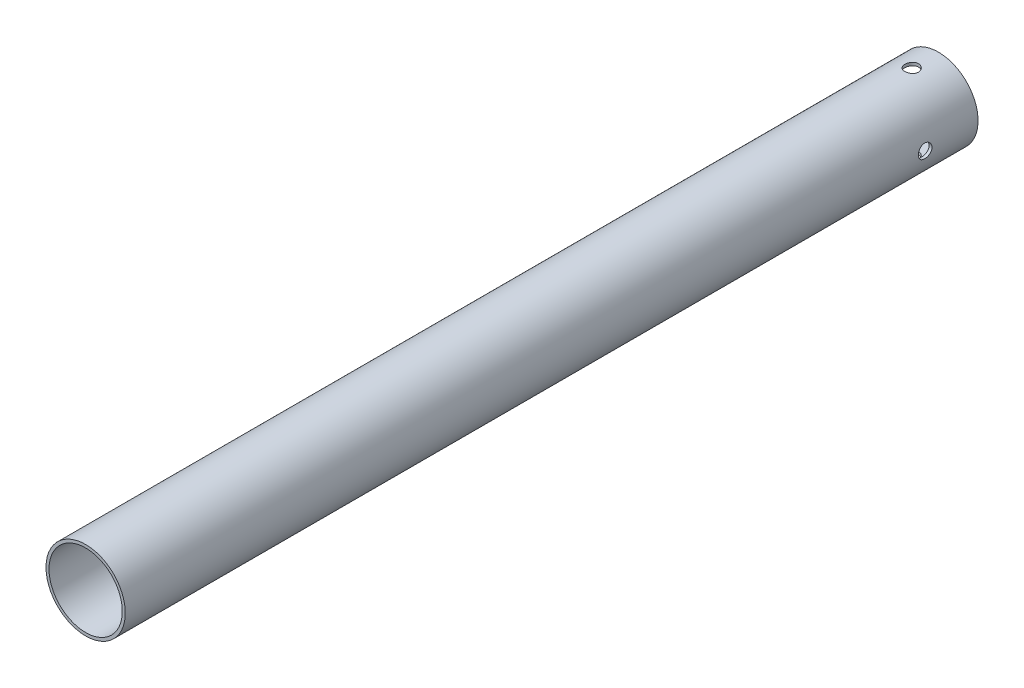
ISO-10303-21;
HEADER;
FILE_DESCRIPTION(('STEP AP214'),'2;1');
FILE_NAME('part.step','',(''),(''),'','','');
FILE_SCHEMA(('AUTOMOTIVE_DESIGN { 1 0 10303 214 1 1 1 1 }'));
ENDSEC;
DATA;
#1=APPLICATION_CONTEXT('core data for automotive mechanical design processes');
#2=APPLICATION_PROTOCOL_DEFINITION('international standard','automotive_design',2000,#1);
#3=PRODUCT_CONTEXT('',#1,'mechanical');
#4=PRODUCT('Part','Part','',(#3));
#5=PRODUCT_RELATED_PRODUCT_CATEGORY('part','',(#4));
#6=PRODUCT_DEFINITION_FORMATION('','',#4);
#7=PRODUCT_DEFINITION_CONTEXT('part definition',#1,'design');
#8=PRODUCT_DEFINITION('design','',#6,#7);
#9=PRODUCT_DEFINITION_SHAPE('','',#8);
#10=(LENGTH_UNIT() NAMED_UNIT(*) SI_UNIT(.MILLI.,.METRE.));
#11=(NAMED_UNIT(*) PLANE_ANGLE_UNIT() SI_UNIT($,.RADIAN.));
#12=(NAMED_UNIT(*) SI_UNIT($,.STERADIAN.) SOLID_ANGLE_UNIT());
#13=UNCERTAINTY_MEASURE_WITH_UNIT(LENGTH_MEASURE(1.E-05),#10,'distance_accuracy_value','');
#14=(GEOMETRIC_REPRESENTATION_CONTEXT(3) GLOBAL_UNCERTAINTY_ASSIGNED_CONTEXT((#13)) GLOBAL_UNIT_ASSIGNED_CONTEXT((#10,
#11,#12)) REPRESENTATION_CONTEXT('',''));
#15=CARTESIAN_POINT('',(0.,0.,0.));
#16=DIRECTION('',(0.,0.,1.));
#17=DIRECTION('',(1.,0.,0.));
#18=AXIS2_PLACEMENT_3D('',#15,#16,#17);
#19=CARTESIAN_POINT('',(0.,0.,153.67));
#20=DIRECTION('',(0.,0.,-1.));
#21=DIRECTION('',(-1.,0.,0.));
#22=AXIS2_PLACEMENT_3D('',#19,#20,#21);
#23=CYLINDRICAL_SURFACE('',#22,13.208);
#24=CARTESIAN_POINT('',(0.,0.,-153.67));
#25=DIRECTION('',(0.,0.,-1.));
#26=DIRECTION('',(-1.,0.,0.));
#27=AXIS2_PLACEMENT_3D('',#24,#25,#26);
#28=CIRCLE('',#27,13.208);
#29=CARTESIAN_POINT('',(-13.208,0.,-153.67));
#30=VERTEX_POINT('',#29);
#31=EDGE_CURVE('E95',#30,#30,#28,.T.);
#32=ORIENTED_EDGE('',*,*,#31,.T.);
#33=EDGE_LOOP('',(#32));
#34=FACE_BOUND('',#33,.T.);
#35=CARTESIAN_POINT('',(-13.208,0.,-132.16255));
#36=CARTESIAN_POINT('',(-13.2079970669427,0.136632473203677,-132.162556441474));
#37=CARTESIAN_POINT('',(-13.2058560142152,0.273436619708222,-132.173993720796));
#38=CARTESIAN_POINT('',(-13.1975150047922,0.543297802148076,-132.219441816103));
#39=CARTESIAN_POINT('',(-13.1913069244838,0.676346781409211,-132.253497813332));
#40=CARTESIAN_POINT('',(-13.175526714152,0.934597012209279,-132.34310879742));
#41=CARTESIAN_POINT('',(-13.1659590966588,1.05980852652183,-132.398634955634));
#42=CARTESIAN_POINT('',(-13.1445076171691,1.29908894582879,-132.529538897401));
#43=CARTESIAN_POINT('',(-13.1326245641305,1.41316172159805,-132.604909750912));
#44=CARTESIAN_POINT('',(-13.1076941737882,1.62833958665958,-132.774324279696));
#45=CARTESIAN_POINT('',(-13.0946357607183,1.729293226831,-132.868558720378));
#46=CARTESIAN_POINT('',(-13.0689083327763,1.91405914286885,-133.072619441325));
#47=CARTESIAN_POINT('',(-13.0562393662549,1.99786929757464,-133.182447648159));
#48=CARTESIAN_POINT('',(-13.0326197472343,2.14658323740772,-133.415629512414));
#49=CARTESIAN_POINT('',(-13.021683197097,2.21133520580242,-133.539081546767));
#50=CARTESIAN_POINT('',(-13.0029207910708,2.31912208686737,-133.795348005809));
#51=CARTESIAN_POINT('',(-12.9950946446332,2.3621590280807,-133.928161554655));
#52=CARTESIAN_POINT('',(-12.9835492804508,2.42481451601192,-134.197778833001));
#53=CARTESIAN_POINT('',(-12.9797842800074,2.44469432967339,-134.334519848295));
#54=CARTESIAN_POINT('',(-12.9766494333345,2.46128212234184,-134.609444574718));
#55=CARTESIAN_POINT('',(-12.977279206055,2.4579921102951,-134.747628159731));
#56=CARTESIAN_POINT('',(-12.9828210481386,2.4285456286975,-135.019623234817));
#57=CARTESIAN_POINT('',(-12.9876774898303,2.40268618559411,-135.153468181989));
#58=CARTESIAN_POINT('',(-13.001038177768,2.32930218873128,-135.414887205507));
#59=CARTESIAN_POINT('',(-13.0095426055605,2.28177655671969,-135.542460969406));
#60=CARTESIAN_POINT('',(-13.029299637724,2.16611626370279,-135.788589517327));
#61=CARTESIAN_POINT('',(-13.0405682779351,2.09786077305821,-135.907086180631));
#62=CARTESIAN_POINT('',(-13.0645723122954,1.94276922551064,-136.131047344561));
#63=CARTESIAN_POINT('',(-13.0773077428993,1.85593270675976,-136.236511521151));
#64=CARTESIAN_POINT('',(-13.103051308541,1.66455838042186,-136.433122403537));
#65=CARTESIAN_POINT('',(-13.1160606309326,1.55976958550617,-136.524024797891));
#66=CARTESIAN_POINT('',(-13.1407127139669,1.33624655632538,-136.68703708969));
#67=CARTESIAN_POINT('',(-13.1523548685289,1.21750618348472,-136.759138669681));
#68=CARTESIAN_POINT('',(-13.1729850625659,0.969165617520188,-136.882532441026));
#69=CARTESIAN_POINT('',(-13.1819677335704,0.839544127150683,-136.933782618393));
#70=CARTESIAN_POINT('',(-13.1962121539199,0.573495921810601,-137.01361157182));
#71=CARTESIAN_POINT('',(-13.201481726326,0.437084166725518,-137.04223802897));
#72=CARTESIAN_POINT('',(-13.2057336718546,0.249713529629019,-137.065243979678));
#73=CARTESIAN_POINT('',(-13.2065816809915,0.199891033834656,-137.069817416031));
#74=CARTESIAN_POINT('',(-13.207715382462,0.100053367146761,-137.075921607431));
#75=CARTESIAN_POINT('',(-13.2080010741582,0.0500381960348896,-137.077452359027));
#76=CARTESIAN_POINT('',(-13.2079970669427,-0.136632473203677,-137.077443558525));
#77=CARTESIAN_POINT('',(-13.2058560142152,-0.273436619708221,-137.066006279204));
#78=CARTESIAN_POINT('',(-13.1975150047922,-0.543297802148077,-137.020558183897));
#79=CARTESIAN_POINT('',(-13.1913069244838,-0.676346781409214,-136.986502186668));
#80=CARTESIAN_POINT('',(-13.175526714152,-0.93459701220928,-136.89689120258));
#81=CARTESIAN_POINT('',(-13.1659590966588,-1.05980852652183,-136.841365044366));
#82=CARTESIAN_POINT('',(-13.1445076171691,-1.29908894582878,-136.710461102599));
#83=CARTESIAN_POINT('',(-13.1326245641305,-1.41316172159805,-136.635090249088));
#84=CARTESIAN_POINT('',(-13.1076941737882,-1.62833958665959,-136.465675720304));
#85=CARTESIAN_POINT('',(-13.0946357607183,-1.72929322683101,-136.371441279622));
#86=CARTESIAN_POINT('',(-13.0689083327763,-1.91405914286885,-136.167380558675));
#87=CARTESIAN_POINT('',(-13.0562393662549,-1.99786929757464,-136.057552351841));
#88=CARTESIAN_POINT('',(-13.0326197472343,-2.14658323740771,-135.824370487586));
#89=CARTESIAN_POINT('',(-13.021683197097,-2.2113352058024,-135.700918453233));
#90=CARTESIAN_POINT('',(-13.0029207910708,-2.31912208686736,-135.444651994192));
#91=CARTESIAN_POINT('',(-12.9950946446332,-2.3621590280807,-135.311838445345));
#92=CARTESIAN_POINT('',(-12.9835492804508,-2.42481451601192,-135.042221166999));
#93=CARTESIAN_POINT('',(-12.9797842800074,-2.44469432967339,-134.905480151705));
#94=CARTESIAN_POINT('',(-12.9766494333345,-2.46128212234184,-134.630555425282));
#95=CARTESIAN_POINT('',(-12.977279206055,-2.4579921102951,-134.492371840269));
#96=CARTESIAN_POINT('',(-12.9828210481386,-2.4285456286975,-134.220376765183));
#97=CARTESIAN_POINT('',(-12.9876774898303,-2.40268618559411,-134.086531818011));
#98=CARTESIAN_POINT('',(-13.001038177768,-2.32930218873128,-133.825112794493));
#99=CARTESIAN_POINT('',(-13.0095426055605,-2.28177655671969,-133.697539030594));
#100=CARTESIAN_POINT('',(-13.029299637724,-2.1661162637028,-133.451410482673));
#101=CARTESIAN_POINT('',(-13.0405682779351,-2.09786077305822,-133.332913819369));
#102=CARTESIAN_POINT('',(-13.0645723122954,-1.94276922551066,-133.108952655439));
#103=CARTESIAN_POINT('',(-13.0773077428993,-1.85593270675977,-133.003488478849));
#104=CARTESIAN_POINT('',(-13.103051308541,-1.66455838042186,-132.806877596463));
#105=CARTESIAN_POINT('',(-13.1160606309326,-1.55976958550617,-132.715975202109));
#106=CARTESIAN_POINT('',(-13.1407127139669,-1.33624655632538,-132.55296291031));
#107=CARTESIAN_POINT('',(-13.1523548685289,-1.21750618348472,-132.480861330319));
#108=CARTESIAN_POINT('',(-13.1729850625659,-0.969165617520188,-132.357467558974));
#109=CARTESIAN_POINT('',(-13.1819677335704,-0.839544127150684,-132.306217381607));
#110=CARTESIAN_POINT('',(-13.1962121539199,-0.573495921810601,-132.22638842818));
#111=CARTESIAN_POINT('',(-13.201481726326,-0.437084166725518,-132.19776197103));
#112=CARTESIAN_POINT('',(-13.2057336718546,-0.249713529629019,-132.174756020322));
#113=CARTESIAN_POINT('',(-13.2065816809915,-0.199891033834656,-132.170182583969));
#114=CARTESIAN_POINT('',(-13.207715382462,-0.100053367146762,-132.164078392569));
#115=CARTESIAN_POINT('',(-13.2080010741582,-0.0500381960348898,-132.162547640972));
#116=CARTESIAN_POINT('',(-13.208,0.,-132.16255));
#117=B_SPLINE_CURVE_WITH_KNOTS('',3,(#35,#36,#37,#38,#39,#40,#41,#42,#43,#44,#45,#46,#47,#48,
#49,#50,#51,#52,#53,#54,#55,#56,#57,#58,#59,#60,#61,#62,#63,#64,#65,#66,#67,#68,#69,#70,#71,#72,
#73,#74,#75,#76,#77,#78,#79,#80,#81,#82,#83,#84,#85,#86,#87,#88,#89,#90,#91,#92,#93,#94,#95,#96,
#97,#98,#99,#100,#101,#102,#103,#104,#105,#106,#107,#108,#109,#110,#111,#112,#113,#114,#115,
#116),.UNSPECIFIED.,.T.,.F.,(4,2,2,2,2,2,2,2,2,2,2,2,2,2,2,2,2,2,2,2,2,2,2,2,2,2,2,2,2,2,2,2,2,
2,2,2,2,2,2,2,4),(0.,0.409706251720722,0.820233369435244,1.23021116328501,1.64004597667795,
2.05425630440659,2.46851785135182,2.88599522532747,3.30343359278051,3.71611520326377,
4.1287610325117,4.53605673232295,4.94337270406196,5.3531099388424,5.76285735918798,
6.17888713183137,6.59510064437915,7.01214869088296,7.42831541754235,7.57835982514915,
7.72840440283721,8.13811065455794,8.54863777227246,8.95861556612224,9.36845037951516,
9.7826607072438,10.196922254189,10.6143996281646,11.0318379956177,11.444519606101,
11.8571654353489,12.2644611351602,12.6717771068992,13.0815143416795,13.4912617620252,
13.9072915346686,14.3235050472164,14.7405530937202,15.1567198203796,15.3067642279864,
15.4568088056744),.UNSPECIFIED.);
#118=CARTESIAN_POINT('',(-13.208,0.,-132.16255));
#119=VERTEX_POINT('',#118);
#120=EDGE_CURVE('E58',#119,#119,#117,.T.);
#121=ORIENTED_EDGE('',*,*,#120,.T.);
#122=EDGE_LOOP('',(#121));
#123=FACE_BOUND('',#122,.T.);
#124=CARTESIAN_POINT('',(0.,0.,153.67));
#125=DIRECTION('',(0.,0.,-1.));
#126=DIRECTION('',(-1.,0.,0.));
#127=AXIS2_PLACEMENT_3D('',#124,#125,#126);
#128=CIRCLE('',#127,13.208);
#129=CARTESIAN_POINT('',(-13.208,0.,153.67));
#130=VERTEX_POINT('',#129);
#131=EDGE_CURVE('E82',#130,#130,#128,.T.);
#132=ORIENTED_EDGE('',*,*,#131,.F.);
#133=EDGE_LOOP('',(#132));
#134=FACE_BOUND('',#133,.T.);
#135=CARTESIAN_POINT('',(0.,13.208,-141.56055));
#136=CARTESIAN_POINT('',(0.136632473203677,13.2079970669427,-141.560556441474));
#137=CARTESIAN_POINT('',(0.273436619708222,13.2058560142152,-141.571993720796));
#138=CARTESIAN_POINT('',(0.543297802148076,13.1975150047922,-141.617441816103));
#139=CARTESIAN_POINT('',(0.676346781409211,13.1913069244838,-141.651497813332));
#140=CARTESIAN_POINT('',(0.934597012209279,13.175526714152,-141.74110879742));
#141=CARTESIAN_POINT('',(1.05980852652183,13.1659590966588,-141.796634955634));
#142=CARTESIAN_POINT('',(1.29908894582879,13.1445076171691,-141.927538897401));
#143=CARTESIAN_POINT('',(1.41316172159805,13.1326245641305,-142.002909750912));
#144=CARTESIAN_POINT('',(1.62833958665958,13.1076941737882,-142.172324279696));
#145=CARTESIAN_POINT('',(1.729293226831,13.0946357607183,-142.266558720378));
#146=CARTESIAN_POINT('',(1.91405914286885,13.0689083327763,-142.470619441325));
#147=CARTESIAN_POINT('',(1.99786929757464,13.0562393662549,-142.580447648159));
#148=CARTESIAN_POINT('',(2.14658323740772,13.0326197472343,-142.813629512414));
#149=CARTESIAN_POINT('',(2.21133520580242,13.021683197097,-142.937081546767));
#150=CARTESIAN_POINT('',(2.31912208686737,13.0029207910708,-143.193348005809));
#151=CARTESIAN_POINT('',(2.3621590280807,12.9950946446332,-143.326161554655));
#152=CARTESIAN_POINT('',(2.42481451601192,12.9835492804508,-143.595778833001));
#153=CARTESIAN_POINT('',(2.44469432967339,12.9797842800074,-143.732519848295));
#154=CARTESIAN_POINT('',(2.46128212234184,12.9766494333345,-144.007444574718));
#155=CARTESIAN_POINT('',(2.4579921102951,12.977279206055,-144.145628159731));
#156=CARTESIAN_POINT('',(2.4285456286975,12.9828210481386,-144.417623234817));
#157=CARTESIAN_POINT('',(2.40268618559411,12.9876774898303,-144.551468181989));
#158=CARTESIAN_POINT('',(2.32930218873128,13.001038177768,-144.812887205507));
#159=CARTESIAN_POINT('',(2.28177655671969,13.0095426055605,-144.940460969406));
#160=CARTESIAN_POINT('',(2.16611626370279,13.029299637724,-145.186589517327));
#161=CARTESIAN_POINT('',(2.09786077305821,13.0405682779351,-145.305086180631));
#162=CARTESIAN_POINT('',(1.94276922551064,13.0645723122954,-145.529047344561));
#163=CARTESIAN_POINT('',(1.85593270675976,13.0773077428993,-145.634511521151));
#164=CARTESIAN_POINT('',(1.66455838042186,13.103051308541,-145.831122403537));
#165=CARTESIAN_POINT('',(1.55976958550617,13.1160606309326,-145.922024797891));
#166=CARTESIAN_POINT('',(1.33624655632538,13.1407127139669,-146.08503708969));
#167=CARTESIAN_POINT('',(1.21750618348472,13.1523548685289,-146.157138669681));
#168=CARTESIAN_POINT('',(0.969165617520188,13.1729850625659,-146.280532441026));
#169=CARTESIAN_POINT('',(0.839544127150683,13.1819677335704,-146.331782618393));
#170=CARTESIAN_POINT('',(0.5734959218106,13.1962121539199,-146.41161157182));
#171=CARTESIAN_POINT('',(0.437084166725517,13.201481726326,-146.44023802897));
#172=CARTESIAN_POINT('',(0.249713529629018,13.2057336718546,-146.463243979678));
#173=CARTESIAN_POINT('',(0.199891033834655,13.2065816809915,-146.467817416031));
#174=CARTESIAN_POINT('',(0.100053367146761,13.207715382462,-146.473921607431));
#175=CARTESIAN_POINT('',(0.05003819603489,13.2080010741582,-146.475452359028));
#176=CARTESIAN_POINT('',(-0.136632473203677,13.2079970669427,-146.475443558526));
#177=CARTESIAN_POINT('',(-0.273436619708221,13.2058560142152,-146.464006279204));
#178=CARTESIAN_POINT('',(-0.543297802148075,13.1975150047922,-146.418558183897));
#179=CARTESIAN_POINT('',(-0.676346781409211,13.1913069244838,-146.384502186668));
#180=CARTESIAN_POINT('',(-0.934597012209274,13.175526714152,-146.29489120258));
#181=CARTESIAN_POINT('',(-1.05980852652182,13.1659590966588,-146.239365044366));
#182=CARTESIAN_POINT('',(-1.29908894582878,13.1445076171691,-146.108461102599));
#183=CARTESIAN_POINT('',(-1.41316172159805,13.1326245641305,-146.033090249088));
#184=CARTESIAN_POINT('',(-1.62833958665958,13.1076941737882,-145.863675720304));
#185=CARTESIAN_POINT('',(-1.729293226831,13.0946357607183,-145.769441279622));
#186=CARTESIAN_POINT('',(-1.91405914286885,13.0689083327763,-145.565380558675));
#187=CARTESIAN_POINT('',(-1.99786929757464,13.0562393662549,-145.455552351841));
#188=CARTESIAN_POINT('',(-2.14658323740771,13.0326197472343,-145.222370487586));
#189=CARTESIAN_POINT('',(-2.2113352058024,13.021683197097,-145.098918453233));
#190=CARTESIAN_POINT('',(-2.31912208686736,13.0029207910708,-144.842651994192));
#191=CARTESIAN_POINT('',(-2.3621590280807,12.9950946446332,-144.709838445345));
#192=CARTESIAN_POINT('',(-2.42481451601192,12.9835492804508,-144.440221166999));
#193=CARTESIAN_POINT('',(-2.44469432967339,12.9797842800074,-144.303480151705));
#194=CARTESIAN_POINT('',(-2.46128212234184,12.9766494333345,-144.028555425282));
#195=CARTESIAN_POINT('',(-2.45799211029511,12.977279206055,-143.890371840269));
#196=CARTESIAN_POINT('',(-2.4285456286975,12.9828210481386,-143.618376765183));
#197=CARTESIAN_POINT('',(-2.4026861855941,12.9876774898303,-143.484531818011));
#198=CARTESIAN_POINT('',(-2.32930218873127,13.001038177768,-143.223112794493));
#199=CARTESIAN_POINT('',(-2.28177655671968,13.0095426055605,-143.095539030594));
#200=CARTESIAN_POINT('',(-2.1661162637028,13.029299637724,-142.849410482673));
#201=CARTESIAN_POINT('',(-2.09786077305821,13.0405682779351,-142.730913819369));
#202=CARTESIAN_POINT('',(-1.94276922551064,13.0645723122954,-142.506952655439));
#203=CARTESIAN_POINT('',(-1.85593270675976,13.0773077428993,-142.401488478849));
#204=CARTESIAN_POINT('',(-1.66455838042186,13.103051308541,-142.204877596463));
#205=CARTESIAN_POINT('',(-1.55976958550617,13.1160606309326,-142.113975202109));
#206=CARTESIAN_POINT('',(-1.33624655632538,13.1407127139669,-141.95096291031));
#207=CARTESIAN_POINT('',(-1.21750618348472,13.1523548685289,-141.878861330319));
#208=CARTESIAN_POINT('',(-0.969165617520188,13.1729850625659,-141.755467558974));
#209=CARTESIAN_POINT('',(-0.839544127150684,13.1819677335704,-141.704217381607));
#210=CARTESIAN_POINT('',(-0.573495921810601,13.1962121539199,-141.62438842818));
#211=CARTESIAN_POINT('',(-0.437084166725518,13.201481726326,-141.59576197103));
#212=CARTESIAN_POINT('',(-0.249713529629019,13.2057336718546,-141.572756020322));
#213=CARTESIAN_POINT('',(-0.199891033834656,13.2065816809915,-141.568182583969));
#214=CARTESIAN_POINT('',(-0.100053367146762,13.207715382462,-141.562078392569));
#215=CARTESIAN_POINT('',(-0.0500381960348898,13.2080010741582,-141.560547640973));
#216=CARTESIAN_POINT('',(0.,13.208,-141.56055));
#217=B_SPLINE_CURVE_WITH_KNOTS('',3,(#135,#136,#137,#138,#139,#140,#141,#142,#143,#144,#145,
#146,#147,#148,#149,#150,#151,#152,#153,#154,#155,#156,#157,#158,#159,#160,#161,#162,#163,#164,
#165,#166,#167,#168,#169,#170,#171,#172,#173,#174,#175,#176,#177,#178,#179,#180,#181,#182,#183,
#184,#185,#186,#187,#188,#189,#190,#191,#192,#193,#194,#195,#196,#197,#198,#199,#200,#201,#202,
#203,#204,#205,#206,#207,#208,#209,#210,#211,#212,#213,#214,#215,#216),.UNSPECIFIED.,.T.,.F.,(4,
2,2,2,2,2,2,2,2,2,2,2,2,2,2,2,2,2,2,2,2,2,2,2,2,2,2,2,2,2,2,2,2,2,2,2,2,2,2,2,4),(0.,
0.409706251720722,0.820233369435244,1.23021116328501,1.64004597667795,2.05425630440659,
2.46851785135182,2.88599522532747,3.30343359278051,3.71611520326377,4.1287610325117,
4.53605673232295,4.94337270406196,5.3531099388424,5.76285735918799,6.17888713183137,
6.59510064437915,7.01214869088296,7.42831541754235,7.57835982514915,7.72840440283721,
8.13811065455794,8.54863777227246,8.95861556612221,9.36845037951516,9.7826607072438,
10.196922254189,10.6143996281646,11.0318379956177,11.444519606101,11.8571654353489,
12.2644611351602,12.6717771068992,13.0815143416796,13.4912617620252,13.9072915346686,
14.3235050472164,14.7405530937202,15.1567198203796,15.3067642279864,15.4568088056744),.UNSPECIFIED.);
#218=CARTESIAN_POINT('',(0.,13.208,-141.56055));
#219=VERTEX_POINT('',#218);
#220=EDGE_CURVE('E77',#219,#219,#217,.T.);
#221=ORIENTED_EDGE('',*,*,#220,.T.);
#222=EDGE_LOOP('',(#221));
#223=FACE_BOUND('',#222,.T.);
#224=CARTESIAN_POINT('',(13.208,0.,-137.07745));
#225=CARTESIAN_POINT('',(13.2079970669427,0.136632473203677,-137.077443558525));
#226=CARTESIAN_POINT('',(13.2058560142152,0.273436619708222,-137.066006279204));
#227=CARTESIAN_POINT('',(13.1975150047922,0.543297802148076,-137.020558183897));
#228=CARTESIAN_POINT('',(13.1913069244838,0.676346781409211,-136.986502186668));
#229=CARTESIAN_POINT('',(13.175526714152,0.934597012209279,-136.89689120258));
#230=CARTESIAN_POINT('',(13.1659590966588,1.05980852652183,-136.841365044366));
#231=CARTESIAN_POINT('',(13.1445076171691,1.29908894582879,-136.710461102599));
#232=CARTESIAN_POINT('',(13.1326245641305,1.41316172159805,-136.635090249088));
#233=CARTESIAN_POINT('',(13.1076941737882,1.62833958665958,-136.465675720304));
#234=CARTESIAN_POINT('',(13.0946357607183,1.729293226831,-136.371441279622));
#235=CARTESIAN_POINT('',(13.0689083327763,1.91405914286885,-136.167380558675));
#236=CARTESIAN_POINT('',(13.0562393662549,1.99786929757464,-136.057552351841));
#237=CARTESIAN_POINT('',(13.0326197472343,2.14658323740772,-135.824370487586));
#238=CARTESIAN_POINT('',(13.021683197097,2.21133520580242,-135.700918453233));
#239=CARTESIAN_POINT('',(13.0029207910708,2.31912208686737,-135.444651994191));
#240=CARTESIAN_POINT('',(12.9950946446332,2.3621590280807,-135.311838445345));
#241=CARTESIAN_POINT('',(12.9835492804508,2.42481451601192,-135.042221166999));
#242=CARTESIAN_POINT('',(12.9797842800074,2.44469432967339,-134.905480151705));
#243=CARTESIAN_POINT('',(12.9766494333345,2.46128212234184,-134.630555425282));
#244=CARTESIAN_POINT('',(12.977279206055,2.45799211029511,-134.492371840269));
#245=CARTESIAN_POINT('',(12.9828210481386,2.4285456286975,-134.220376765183));
#246=CARTESIAN_POINT('',(12.9876774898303,2.4026861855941,-134.086531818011));
#247=CARTESIAN_POINT('',(13.001038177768,2.32930218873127,-133.825112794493));
#248=CARTESIAN_POINT('',(13.0095426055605,2.28177655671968,-133.697539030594));
#249=CARTESIAN_POINT('',(13.029299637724,2.1661162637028,-133.451410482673));
#250=CARTESIAN_POINT('',(13.0405682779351,2.0978607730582,-133.332913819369));
#251=CARTESIAN_POINT('',(13.0645723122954,1.94276922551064,-133.108952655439));
#252=CARTESIAN_POINT('',(13.0773077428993,1.85593270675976,-133.003488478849));
#253=CARTESIAN_POINT('',(13.103051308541,1.66455838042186,-132.806877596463));
#254=CARTESIAN_POINT('',(13.1160606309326,1.55976958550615,-132.715975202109));
#255=CARTESIAN_POINT('',(13.1407127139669,1.33624655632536,-132.55296291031));
#256=CARTESIAN_POINT('',(13.1523548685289,1.21750618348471,-132.480861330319));
#257=CARTESIAN_POINT('',(13.1729850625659,0.96916561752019,-132.357467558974));
#258=CARTESIAN_POINT('',(13.1819677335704,0.839544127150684,-132.306217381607));
#259=CARTESIAN_POINT('',(13.1962121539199,0.5734959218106,-132.22638842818));
#260=CARTESIAN_POINT('',(13.201481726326,0.437084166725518,-132.19776197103));
#261=CARTESIAN_POINT('',(13.2057336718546,0.249713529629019,-132.174756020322));
#262=CARTESIAN_POINT('',(13.2065816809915,0.199891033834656,-132.170182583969));
#263=CARTESIAN_POINT('',(13.207715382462,0.100053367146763,-132.164078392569));
#264=CARTESIAN_POINT('',(13.2080010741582,0.0500381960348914,-132.162547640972));
#265=CARTESIAN_POINT('',(13.2079970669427,-0.136632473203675,-132.162556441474));
#266=CARTESIAN_POINT('',(13.2058560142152,-0.27343661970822,-132.173993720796));
#267=CARTESIAN_POINT('',(13.1975150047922,-0.543297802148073,-132.219441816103));
#268=CARTESIAN_POINT('',(13.1913069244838,-0.676346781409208,-132.253497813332));
#269=CARTESIAN_POINT('',(13.175526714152,-0.934597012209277,-132.34310879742));
#270=CARTESIAN_POINT('',(13.1659590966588,-1.05980852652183,-132.398634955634));
#271=CARTESIAN_POINT('',(13.1445076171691,-1.29908894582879,-132.529538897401));
#272=CARTESIAN_POINT('',(13.1326245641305,-1.41316172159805,-132.604909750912));
#273=CARTESIAN_POINT('',(13.1076941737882,-1.62833958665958,-132.774324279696));
#274=CARTESIAN_POINT('',(13.0946357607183,-1.729293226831,-132.868558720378));
#275=CARTESIAN_POINT('',(13.0689083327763,-1.91405914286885,-133.072619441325));
#276=CARTESIAN_POINT('',(13.0562393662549,-1.99786929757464,-133.182447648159));
#277=CARTESIAN_POINT('',(13.0326197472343,-2.14658323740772,-133.415629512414));
#278=CARTESIAN_POINT('',(13.021683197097,-2.21133520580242,-133.539081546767));
#279=CARTESIAN_POINT('',(13.0029207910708,-2.31912208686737,-133.795348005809));
#280=CARTESIAN_POINT('',(12.9950946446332,-2.3621590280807,-133.928161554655));
#281=CARTESIAN_POINT('',(12.9835492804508,-2.42481451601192,-134.197778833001));
#282=CARTESIAN_POINT('',(12.9797842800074,-2.4446943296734,-134.334519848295));
#283=CARTESIAN_POINT('',(12.9766494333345,-2.46128212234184,-134.609444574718));
#284=CARTESIAN_POINT('',(12.977279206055,-2.4579921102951,-134.747628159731));
#285=CARTESIAN_POINT('',(12.9828210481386,-2.4285456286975,-135.019623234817));
#286=CARTESIAN_POINT('',(12.9876774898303,-2.40268618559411,-135.153468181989));
#287=CARTESIAN_POINT('',(13.001038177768,-2.32930218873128,-135.414887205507));
#288=CARTESIAN_POINT('',(13.0095426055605,-2.28177655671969,-135.542460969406));
#289=CARTESIAN_POINT('',(13.029299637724,-2.16611626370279,-135.788589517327));
#290=CARTESIAN_POINT('',(13.0405682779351,-2.09786077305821,-135.907086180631));
#291=CARTESIAN_POINT('',(13.0645723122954,-1.94276922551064,-136.131047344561));
#292=CARTESIAN_POINT('',(13.0773077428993,-1.85593270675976,-136.236511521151));
#293=CARTESIAN_POINT('',(13.103051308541,-1.66455838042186,-136.433122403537));
#294=CARTESIAN_POINT('',(13.1160606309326,-1.55976958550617,-136.524024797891));
#295=CARTESIAN_POINT('',(13.1407127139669,-1.33624655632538,-136.68703708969));
#296=CARTESIAN_POINT('',(13.1523548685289,-1.21750618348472,-136.759138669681));
#297=CARTESIAN_POINT('',(13.1729850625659,-0.969165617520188,-136.882532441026));
#298=CARTESIAN_POINT('',(13.1819677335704,-0.839544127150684,-136.933782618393));
#299=CARTESIAN_POINT('',(13.1962121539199,-0.573495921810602,-137.01361157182));
#300=CARTESIAN_POINT('',(13.201481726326,-0.437084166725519,-137.04223802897));
#301=CARTESIAN_POINT('',(13.2057336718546,-0.24971352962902,-137.065243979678));
#302=CARTESIAN_POINT('',(13.2065816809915,-0.199891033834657,-137.069817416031));
#303=CARTESIAN_POINT('',(13.207715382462,-0.100053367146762,-137.075921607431));
#304=CARTESIAN_POINT('',(13.2080010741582,-0.0500381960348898,-137.077452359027));
#305=CARTESIAN_POINT('',(13.208,0.,-137.07745));
#306=B_SPLINE_CURVE_WITH_KNOTS('',3,(#224,#225,#226,#227,#228,#229,#230,#231,#232,#233,#234,
#235,#236,#237,#238,#239,#240,#241,#242,#243,#244,#245,#246,#247,#248,#249,#250,#251,#252,#253,
#254,#255,#256,#257,#258,#259,#260,#261,#262,#263,#264,#265,#266,#267,#268,#269,#270,#271,#272,
#273,#274,#275,#276,#277,#278,#279,#280,#281,#282,#283,#284,#285,#286,#287,#288,#289,#290,#291,
#292,#293,#294,#295,#296,#297,#298,#299,#300,#301,#302,#303,#304,#305),.UNSPECIFIED.,.T.,.F.,(4,
2,2,2,2,2,2,2,2,2,2,2,2,2,2,2,2,2,2,2,2,2,2,2,2,2,2,2,2,2,2,2,2,2,2,2,2,2,2,2,4),(0.,
0.409706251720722,0.820233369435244,1.23021116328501,1.64004597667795,2.05425630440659,
2.46851785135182,2.88599522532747,3.30343359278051,3.71611520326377,4.1287610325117,
4.53605673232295,4.94337270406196,5.3531099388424,5.76285735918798,6.17888713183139,
6.59510064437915,7.01214869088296,7.42831541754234,7.57835982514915,7.72840440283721,
8.13811065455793,8.54863777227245,8.95861556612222,9.36845037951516,9.7826607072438,
10.196922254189,10.6143996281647,11.0318379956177,11.444519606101,11.8571654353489,
12.2644611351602,12.6717771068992,13.0815143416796,13.4912617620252,13.9072915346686,
14.3235050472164,14.7405530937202,15.1567198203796,15.3067642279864,15.4568088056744),.UNSPECIFIED.);
#307=CARTESIAN_POINT('',(13.208,0.,-137.07745));
#308=VERTEX_POINT('',#307);
#309=EDGE_CURVE('E87',#308,#308,#306,.T.);
#310=ORIENTED_EDGE('',*,*,#309,.T.);
#311=EDGE_LOOP('',(#310));
#312=FACE_BOUND('',#311,.T.);
#313=CARTESIAN_POINT('',(0.,-13.208,-141.56055));
#314=CARTESIAN_POINT('',(-0.136632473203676,-13.2079970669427,-141.560556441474));
#315=CARTESIAN_POINT('',(-0.273436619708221,-13.2058560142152,-141.571993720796));
#316=CARTESIAN_POINT('',(-0.543297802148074,-13.1975150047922,-141.617441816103));
#317=CARTESIAN_POINT('',(-0.676346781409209,-13.1913069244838,-141.651497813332));
#318=CARTESIAN_POINT('',(-0.934597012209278,-13.175526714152,-141.74110879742));
#319=CARTESIAN_POINT('',(-1.05980852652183,-13.1659590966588,-141.796634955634));
#320=CARTESIAN_POINT('',(-1.29908894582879,-13.1445076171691,-141.927538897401));
#321=CARTESIAN_POINT('',(-1.41316172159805,-13.1326245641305,-142.002909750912));
#322=CARTESIAN_POINT('',(-1.62833958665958,-13.1076941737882,-142.172324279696));
#323=CARTESIAN_POINT('',(-1.729293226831,-13.0946357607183,-142.266558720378));
#324=CARTESIAN_POINT('',(-1.91405914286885,-13.0689083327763,-142.470619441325));
#325=CARTESIAN_POINT('',(-1.99786929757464,-13.0562393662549,-142.580447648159));
#326=CARTESIAN_POINT('',(-2.14658323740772,-13.0326197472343,-142.813629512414));
#327=CARTESIAN_POINT('',(-2.21133520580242,-13.021683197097,-142.937081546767));
#328=CARTESIAN_POINT('',(-2.31912208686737,-13.0029207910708,-143.193348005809));
#329=CARTESIAN_POINT('',(-2.3621590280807,-12.9950946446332,-143.326161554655));
#330=CARTESIAN_POINT('',(-2.42481451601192,-12.9835492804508,-143.595778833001));
#331=CARTESIAN_POINT('',(-2.44469432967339,-12.9797842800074,-143.732519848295));
#332=CARTESIAN_POINT('',(-2.46128212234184,-12.9766494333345,-144.007444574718));
#333=CARTESIAN_POINT('',(-2.4579921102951,-12.977279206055,-144.145628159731));
#334=CARTESIAN_POINT('',(-2.4285456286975,-12.9828210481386,-144.417623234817));
#335=CARTESIAN_POINT('',(-2.40268618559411,-12.9876774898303,-144.551468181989));
#336=CARTESIAN_POINT('',(-2.32930218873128,-13.001038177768,-144.812887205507));
#337=CARTESIAN_POINT('',(-2.28177655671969,-13.0095426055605,-144.940460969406));
#338=CARTESIAN_POINT('',(-2.16611626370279,-13.029299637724,-145.186589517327));
#339=CARTESIAN_POINT('',(-2.09786077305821,-13.0405682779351,-145.305086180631));
#340=CARTESIAN_POINT('',(-1.94276922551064,-13.0645723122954,-145.529047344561));
#341=CARTESIAN_POINT('',(-1.85593270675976,-13.0773077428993,-145.634511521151));
#342=CARTESIAN_POINT('',(-1.66455838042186,-13.103051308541,-145.831122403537));
#343=CARTESIAN_POINT('',(-1.55976958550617,-13.1160606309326,-145.922024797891));
#344=CARTESIAN_POINT('',(-1.33624655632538,-13.1407127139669,-146.08503708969));
#345=CARTESIAN_POINT('',(-1.21750618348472,-13.1523548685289,-146.157138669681));
#346=CARTESIAN_POINT('',(-0.969165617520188,-13.1729850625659,-146.280532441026));
#347=CARTESIAN_POINT('',(-0.839544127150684,-13.1819677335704,-146.331782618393));
#348=CARTESIAN_POINT('',(-0.573495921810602,-13.1962121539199,-146.41161157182));
#349=CARTESIAN_POINT('',(-0.437084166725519,-13.201481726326,-146.44023802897));
#350=CARTESIAN_POINT('',(-0.249713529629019,-13.2057336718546,-146.463243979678));
#351=CARTESIAN_POINT('',(-0.199891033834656,-13.2065816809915,-146.467817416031));
#352=CARTESIAN_POINT('',(-0.100053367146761,-13.207715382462,-146.473921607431));
#353=CARTESIAN_POINT('',(-0.0500381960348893,-13.2080010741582,-146.475452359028));
#354=CARTESIAN_POINT('',(0.136632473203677,-13.2079970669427,-146.475443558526));
#355=CARTESIAN_POINT('',(0.273436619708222,-13.2058560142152,-146.464006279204));
#356=CARTESIAN_POINT('',(0.543297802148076,-13.1975150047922,-146.418558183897));
#357=CARTESIAN_POINT('',(0.676346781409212,-13.1913069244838,-146.384502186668));
#358=CARTESIAN_POINT('',(0.934597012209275,-13.175526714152,-146.29489120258));
#359=CARTESIAN_POINT('',(1.05980852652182,-13.1659590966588,-146.239365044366));
#360=CARTESIAN_POINT('',(1.29908894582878,-13.1445076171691,-146.108461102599));
#361=CARTESIAN_POINT('',(1.41316172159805,-13.1326245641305,-146.033090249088));
#362=CARTESIAN_POINT('',(1.62833958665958,-13.1076941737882,-145.863675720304));
#363=CARTESIAN_POINT('',(1.729293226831,-13.0946357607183,-145.769441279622));
#364=CARTESIAN_POINT('',(1.91405914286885,-13.0689083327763,-145.565380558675));
#365=CARTESIAN_POINT('',(1.99786929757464,-13.0562393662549,-145.455552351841));
#366=CARTESIAN_POINT('',(2.14658323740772,-13.0326197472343,-145.222370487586));
#367=CARTESIAN_POINT('',(2.21133520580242,-13.021683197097,-145.098918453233));
#368=CARTESIAN_POINT('',(2.31912208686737,-13.0029207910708,-144.842651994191));
#369=CARTESIAN_POINT('',(2.3621590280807,-12.9950946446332,-144.709838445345));
#370=CARTESIAN_POINT('',(2.42481451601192,-12.9835492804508,-144.440221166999));
#371=CARTESIAN_POINT('',(2.44469432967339,-12.9797842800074,-144.303480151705));
#372=CARTESIAN_POINT('',(2.46128212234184,-12.9766494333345,-144.028555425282));
#373=CARTESIAN_POINT('',(2.45799211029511,-12.977279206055,-143.890371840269));
#374=CARTESIAN_POINT('',(2.4285456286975,-12.9828210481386,-143.618376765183));
#375=CARTESIAN_POINT('',(2.4026861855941,-12.9876774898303,-143.484531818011));
#376=CARTESIAN_POINT('',(2.32930218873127,-13.001038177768,-143.223112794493));
#377=CARTESIAN_POINT('',(2.28177655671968,-13.0095426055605,-143.095539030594));
#378=CARTESIAN_POINT('',(2.1661162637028,-13.029299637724,-142.849410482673));
#379=CARTESIAN_POINT('',(2.09786077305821,-13.0405682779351,-142.730913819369));
#380=CARTESIAN_POINT('',(1.94276922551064,-13.0645723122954,-142.506952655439));
#381=CARTESIAN_POINT('',(1.85593270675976,-13.0773077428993,-142.401488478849));
#382=CARTESIAN_POINT('',(1.66455838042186,-13.103051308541,-142.204877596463));
#383=CARTESIAN_POINT('',(1.55976958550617,-13.1160606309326,-142.113975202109));
#384=CARTESIAN_POINT('',(1.33624655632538,-13.1407127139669,-141.95096291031));
#385=CARTESIAN_POINT('',(1.21750618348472,-13.1523548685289,-141.878861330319));
#386=CARTESIAN_POINT('',(0.969165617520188,-13.1729850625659,-141.755467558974));
#387=CARTESIAN_POINT('',(0.839544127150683,-13.1819677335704,-141.704217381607));
#388=CARTESIAN_POINT('',(0.5734959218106,-13.1962121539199,-141.62438842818));
#389=CARTESIAN_POINT('',(0.437084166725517,-13.201481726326,-141.59576197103));
#390=CARTESIAN_POINT('',(0.249713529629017,-13.2057336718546,-141.572756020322));
#391=CARTESIAN_POINT('',(0.199891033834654,-13.2065816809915,-141.568182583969));
#392=CARTESIAN_POINT('',(0.100053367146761,-13.207715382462,-141.562078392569));
#393=CARTESIAN_POINT('',(0.0500381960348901,-13.2080010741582,-141.560547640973));
#394=CARTESIAN_POINT('',(0.,-13.208,-141.56055));
#395=B_SPLINE_CURVE_WITH_KNOTS('',3,(#313,#314,#315,#316,#317,#318,#319,#320,#321,#322,#323,
#324,#325,#326,#327,#328,#329,#330,#331,#332,#333,#334,#335,#336,#337,#338,#339,#340,#341,#342,
#343,#344,#345,#346,#347,#348,#349,#350,#351,#352,#353,#354,#355,#356,#357,#358,#359,#360,#361,
#362,#363,#364,#365,#366,#367,#368,#369,#370,#371,#372,#373,#374,#375,#376,#377,#378,#379,#380,
#381,#382,#383,#384,#385,#386,#387,#388,#389,#390,#391,#392,#393,#394),.UNSPECIFIED.,.T.,.F.,(4,
2,2,2,2,2,2,2,2,2,2,2,2,2,2,2,2,2,2,2,2,2,2,2,2,2,2,2,2,2,2,2,2,2,2,2,2,2,2,2,4),(0.,
0.409706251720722,0.820233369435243,1.23021116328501,1.64004597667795,2.05425630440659,
2.46851785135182,2.88599522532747,3.30343359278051,3.71611520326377,4.1287610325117,
4.53605673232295,4.94337270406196,5.3531099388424,5.76285735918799,6.17888713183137,
6.59510064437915,7.01214869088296,7.42831541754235,7.57835982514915,7.72840440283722,
8.13811065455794,8.54863777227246,8.95861556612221,9.36845037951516,9.7826607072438,
10.196922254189,10.6143996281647,11.0318379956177,11.444519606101,11.8571654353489,
12.2644611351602,12.6717771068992,13.0815143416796,13.4912617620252,13.9072915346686,
14.3235050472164,14.7405530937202,15.1567198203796,15.3067642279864,15.4568088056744),.UNSPECIFIED.);
#396=CARTESIAN_POINT('',(0.,-13.208,-141.56055));
#397=VERTEX_POINT('',#396);
#398=EDGE_CURVE('E16',#397,#397,#395,.T.);
#399=ORIENTED_EDGE('',*,*,#398,.T.);
#400=EDGE_LOOP('',(#399));
#401=FACE_BOUND('',#400,.T.);
#402=ADVANCED_FACE('F12',(#34,#123,#134,#223,#312,#401),#23,.F.);
#403=CARTESIAN_POINT('',(0.,14.2875,-144.018));
#404=DIRECTION('',(0.,1.,0.));
#405=DIRECTION('',(0.,0.,1.));
#406=AXIS2_PLACEMENT_3D('',#403,#404,#405);
#407=CYLINDRICAL_SURFACE('',#406,2.45745);
#408=ORIENTED_EDGE('',*,*,#398,.F.);
#409=EDGE_LOOP('',(#408));
#410=FACE_BOUND('',#409,.T.);
#411=CARTESIAN_POINT('',(0.,-14.2875,-146.47545));
#412=CARTESIAN_POINT('',(-0.136817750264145,-14.2874973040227,-146.475443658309));
#413=CARTESIAN_POINT('',(-0.273809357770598,-14.2855125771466,-146.463975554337));
#414=CARTESIAN_POINT('',(-0.544049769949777,-14.2777808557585,-146.418399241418));
#415=CARTESIAN_POINT('',(-0.677290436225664,-14.2720262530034,-146.384245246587));
#416=CARTESIAN_POINT('',(-0.935925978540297,-14.2573999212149,-146.294359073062));
#417=CARTESIAN_POINT('',(-1.06133058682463,-14.2485321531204,-146.238654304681));
#418=CARTESIAN_POINT('',(-1.30096184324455,-14.2286551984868,-146.107312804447));
#419=CARTESIAN_POINT('',(-1.41519256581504,-14.217646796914,-146.031683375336));
#420=CARTESIAN_POINT('',(-1.63046228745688,-14.1945796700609,-145.861806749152));
#421=CARTESIAN_POINT('',(-1.73137032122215,-14.18251221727,-145.767394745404));
#422=CARTESIAN_POINT('',(-1.91600065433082,-14.1587529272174,-145.562983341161));
#423=CARTESIAN_POINT('',(-1.99972094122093,-14.1470611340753,-145.452982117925));
#424=CARTESIAN_POINT('',(-2.14811519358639,-14.1252942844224,-145.219625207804));
#425=CARTESIAN_POINT('',(-2.21266060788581,-14.1152303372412,-145.096186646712));
#426=CARTESIAN_POINT('',(-2.32004981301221,-14.0979786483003,-144.840018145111));
#427=CARTESIAN_POINT('',(-2.36289535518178,-14.0907906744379,-144.707288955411));
#428=CARTESIAN_POINT('',(-2.42525964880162,-14.0801907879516,-144.437681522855));
#429=CARTESIAN_POINT('',(-2.44500247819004,-14.0767426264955,-144.300856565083));
#430=CARTESIAN_POINT('',(-2.4612958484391,-14.0739032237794,-144.025795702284));
#431=CARTESIAN_POINT('',(-2.4578480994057,-14.0745116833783,-143.887559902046));
#432=CARTESIAN_POINT('',(-2.42804056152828,-14.0796836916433,-143.615208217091));
#433=CARTESIAN_POINT('',(-2.40193344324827,-14.0842036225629,-143.48106372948));
#434=CARTESIAN_POINT('',(-2.32794474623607,-14.0966210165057,-143.219086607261));
#435=CARTESIAN_POINT('',(-2.28006219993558,-14.1045186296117,-143.091254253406));
#436=CARTESIAN_POINT('',(-2.16362613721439,-14.1228485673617,-142.844775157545));
#437=CARTESIAN_POINT('',(-2.09496775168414,-14.1332936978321,-142.726178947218));
#438=CARTESIAN_POINT('',(-1.9390089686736,-14.155531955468,-142.502104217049));
#439=CARTESIAN_POINT('',(-1.85170839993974,-14.1673250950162,-142.396625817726));
#440=CARTESIAN_POINT('',(-1.659587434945,-14.1911203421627,-142.200326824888));
#441=CARTESIAN_POINT('',(-1.55455356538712,-14.203123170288,-142.109715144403));
#442=CARTESIAN_POINT('',(-1.33060746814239,-14.2258492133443,-141.94732923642));
#443=CARTESIAN_POINT('',(-1.2116890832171,-14.2365718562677,-141.875563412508));
#444=CARTESIAN_POINT('',(-0.963116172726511,-14.2555471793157,-141.752890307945));
#445=CARTESIAN_POINT('',(-0.833443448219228,-14.2637955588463,-141.702019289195));
#446=CARTESIAN_POINT('',(-0.5673909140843,-14.2768471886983,-141.622939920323));
#447=CARTESIAN_POINT('',(-0.431025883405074,-14.2816576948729,-141.594683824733));
#448=CARTESIAN_POINT('',(-0.244721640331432,-14.2854879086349,-141.572271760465));
#449=CARTESIAN_POINT('',(-0.195890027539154,-14.2862408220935,-141.567879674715));
#450=CARTESIAN_POINT('',(-0.0980463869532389,-14.2872473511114,-141.562017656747));
#451=CARTESIAN_POINT('',(-0.0490343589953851,-14.2875009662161,-141.56054772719));
#452=CARTESIAN_POINT('',(0.136817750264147,-14.2874973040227,-141.560556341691));
#453=CARTESIAN_POINT('',(0.273809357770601,-14.2855125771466,-141.572024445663));
#454=CARTESIAN_POINT('',(0.54404976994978,-14.2777808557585,-141.617600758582));
#455=CARTESIAN_POINT('',(0.677290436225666,-14.2720262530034,-141.651754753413));
#456=CARTESIAN_POINT('',(0.935925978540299,-14.2573999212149,-141.741640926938));
#457=CARTESIAN_POINT('',(1.06133058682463,-14.2485321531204,-141.797345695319));
#458=CARTESIAN_POINT('',(1.30096184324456,-14.2286551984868,-141.928687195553));
#459=CARTESIAN_POINT('',(1.41519256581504,-14.217646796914,-142.004316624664));
#460=CARTESIAN_POINT('',(1.63046228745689,-14.1945796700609,-142.174193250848));
#461=CARTESIAN_POINT('',(1.73137032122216,-14.18251221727,-142.268605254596));
#462=CARTESIAN_POINT('',(1.91600065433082,-14.1587529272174,-142.473016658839));
#463=CARTESIAN_POINT('',(1.99972094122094,-14.1470611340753,-142.583017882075));
#464=CARTESIAN_POINT('',(2.14811519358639,-14.1252942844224,-142.816374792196));
#465=CARTESIAN_POINT('',(2.21266060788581,-14.1152303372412,-142.939813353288));
#466=CARTESIAN_POINT('',(2.32004981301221,-14.0979786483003,-143.195981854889));
#467=CARTESIAN_POINT('',(2.36289535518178,-14.0907906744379,-143.328711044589));
#468=CARTESIAN_POINT('',(2.42525964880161,-14.0801907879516,-143.598318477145));
#469=CARTESIAN_POINT('',(2.44500247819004,-14.0767426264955,-143.735143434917));
#470=CARTESIAN_POINT('',(2.4612958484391,-14.0739032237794,-144.010204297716));
#471=CARTESIAN_POINT('',(2.4578480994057,-14.0745116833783,-144.148440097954));
#472=CARTESIAN_POINT('',(2.42804056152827,-14.0796836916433,-144.420791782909));
#473=CARTESIAN_POINT('',(2.40193344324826,-14.0842036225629,-144.55493627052));
#474=CARTESIAN_POINT('',(2.32794474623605,-14.0966210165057,-144.816913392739));
#475=CARTESIAN_POINT('',(2.28006219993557,-14.1045186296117,-144.944745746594));
#476=CARTESIAN_POINT('',(2.16362613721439,-14.1228485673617,-145.191224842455));
#477=CARTESIAN_POINT('',(2.09496775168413,-14.1332936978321,-145.309821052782));
#478=CARTESIAN_POINT('',(1.93900896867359,-14.155531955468,-145.533895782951));
#479=CARTESIAN_POINT('',(1.85170839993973,-14.1673250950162,-145.639374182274));
#480=CARTESIAN_POINT('',(1.659587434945,-14.1911203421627,-145.835673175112));
#481=CARTESIAN_POINT('',(1.55455356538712,-14.203123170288,-145.926284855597));
#482=CARTESIAN_POINT('',(1.33060746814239,-14.2258492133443,-146.08867076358));
#483=CARTESIAN_POINT('',(1.2116890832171,-14.2365718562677,-146.160436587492));
#484=CARTESIAN_POINT('',(0.963116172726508,-14.2555471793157,-146.283109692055));
#485=CARTESIAN_POINT('',(0.833443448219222,-14.2637955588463,-146.333980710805));
#486=CARTESIAN_POINT('',(0.567390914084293,-14.2768471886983,-146.413060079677));
#487=CARTESIAN_POINT('',(0.431025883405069,-14.2816576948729,-146.441316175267));
#488=CARTESIAN_POINT('',(0.244721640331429,-14.2854879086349,-146.463728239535));
#489=CARTESIAN_POINT('',(0.19589002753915,-14.2862408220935,-146.468120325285));
#490=CARTESIAN_POINT('',(0.0980463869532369,-14.2872473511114,-146.473982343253));
#491=CARTESIAN_POINT('',(0.0490343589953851,-14.2875009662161,-146.47545227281));
#492=CARTESIAN_POINT('',(0.,-14.2875,-146.47545));
#493=B_SPLINE_CURVE_WITH_KNOTS('',3,(#411,#412,#413,#414,#415,#416,#417,#418,#419,#420,#421,
#422,#423,#424,#425,#426,#427,#428,#429,#430,#431,#432,#433,#434,#435,#436,#437,#438,#439,#440,
#441,#442,#443,#444,#445,#446,#447,#448,#449,#450,#451,#452,#453,#454,#455,#456,#457,#458,#459,
#460,#461,#462,#463,#464,#465,#466,#467,#468,#469,#470,#471,#472,#473,#474,#475,#476,#477,#478,
#479,#480,#481,#482,#483,#484,#485,#486,#487,#488,#489,#490,#491,#492),.UNSPECIFIED.,.T.,.F.,(4,
2,2,2,2,2,2,2,2,2,2,2,2,2,2,2,2,2,2,2,2,2,2,2,2,2,2,2,2,2,2,2,2,2,2,2,2,2,2,2,4),(0.,
0.410266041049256,0.821362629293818,1.23193805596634,1.64236320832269,2.05656247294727,
2.47081020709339,2.88777549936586,3.30470713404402,3.71756043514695,4.13038329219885,
4.53866112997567,4.94695711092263,5.35734941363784,5.76774548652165,6.18348934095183,
6.59941826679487,7.01606599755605,7.43183174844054,7.57886759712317,7.72590357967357,
8.13616962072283,8.54726620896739,8.95784163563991,9.36826678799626,9.78246605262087,
10.196713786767,10.6136790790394,11.0306107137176,11.4434640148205,11.8562868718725,
12.2645647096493,12.6728606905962,13.0832529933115,13.4936490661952,13.9093929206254,
14.3253218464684,14.7419695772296,15.1577353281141,15.3047711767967,15.4518071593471),.UNSPECIFIED.);
#494=CARTESIAN_POINT('',(0.,-14.2875,-146.47545));
#495=VERTEX_POINT('',#494);
#496=EDGE_CURVE('E53',#495,#495,#493,.T.);
#497=ORIENTED_EDGE('',*,*,#496,.F.);
#498=EDGE_LOOP('',(#497));
#499=FACE_BOUND('',#498,.T.);
#500=ADVANCED_FACE('F65',(#410,#499),#407,.F.);
#501=CARTESIAN_POINT('',(0.,14.2875,-144.018));
#502=DIRECTION('',(0.,1.,0.));
#503=DIRECTION('',(0.,0.,1.));
#504=AXIS2_PLACEMENT_3D('',#501,#502,#503);
#505=CYLINDRICAL_SURFACE('',#504,2.45745);
#506=ORIENTED_EDGE('',*,*,#220,.F.);
#507=EDGE_LOOP('',(#506));
#508=FACE_BOUND('',#507,.T.);
#509=CARTESIAN_POINT('',(0.,14.2875,-141.56055));
#510=CARTESIAN_POINT('',(-0.136817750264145,14.2874973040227,-141.560556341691));
#511=CARTESIAN_POINT('',(-0.273809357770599,14.2855125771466,-141.572024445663));
#512=CARTESIAN_POINT('',(-0.544049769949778,14.2777808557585,-141.617600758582));
#513=CARTESIAN_POINT('',(-0.677290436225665,14.2720262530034,-141.651754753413));
#514=CARTESIAN_POINT('',(-0.935925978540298,14.2573999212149,-141.741640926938));
#515=CARTESIAN_POINT('',(-1.06133058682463,14.2485321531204,-141.797345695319));
#516=CARTESIAN_POINT('',(-1.30096184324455,14.2286551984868,-141.928687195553));
#517=CARTESIAN_POINT('',(-1.41519256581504,14.217646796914,-142.004316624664));
#518=CARTESIAN_POINT('',(-1.63046228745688,14.1945796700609,-142.174193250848));
#519=CARTESIAN_POINT('',(-1.73137032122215,14.18251221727,-142.268605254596));
#520=CARTESIAN_POINT('',(-1.91600065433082,14.1587529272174,-142.473016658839));
#521=CARTESIAN_POINT('',(-1.99972094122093,14.1470611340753,-142.583017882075));
#522=CARTESIAN_POINT('',(-2.14811519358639,14.1252942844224,-142.816374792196));
#523=CARTESIAN_POINT('',(-2.21266060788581,14.1152303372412,-142.939813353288));
#524=CARTESIAN_POINT('',(-2.32004981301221,14.0979786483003,-143.195981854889));
#525=CARTESIAN_POINT('',(-2.36289535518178,14.0907906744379,-143.328711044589));
#526=CARTESIAN_POINT('',(-2.42525964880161,14.0801907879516,-143.598318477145));
#527=CARTESIAN_POINT('',(-2.44500247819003,14.0767426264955,-143.735143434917));
#528=CARTESIAN_POINT('',(-2.4612958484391,14.0739032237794,-144.010204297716));
#529=CARTESIAN_POINT('',(-2.4578480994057,14.0745116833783,-144.148440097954));
#530=CARTESIAN_POINT('',(-2.42804056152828,14.0796836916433,-144.420791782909));
#531=CARTESIAN_POINT('',(-2.40193344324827,14.0842036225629,-144.55493627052));
#532=CARTESIAN_POINT('',(-2.32794474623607,14.0966210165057,-144.816913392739));
#533=CARTESIAN_POINT('',(-2.28006219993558,14.1045186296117,-144.944745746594));
#534=CARTESIAN_POINT('',(-2.16362613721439,14.1228485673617,-145.191224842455));
#535=CARTESIAN_POINT('',(-2.09496775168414,14.1332936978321,-145.309821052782));
#536=CARTESIAN_POINT('',(-1.9390089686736,14.155531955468,-145.533895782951));
#537=CARTESIAN_POINT('',(-1.85170839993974,14.1673250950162,-145.639374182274));
#538=CARTESIAN_POINT('',(-1.659587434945,14.1911203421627,-145.835673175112));
#539=CARTESIAN_POINT('',(-1.55455356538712,14.203123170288,-145.926284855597));
#540=CARTESIAN_POINT('',(-1.33060746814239,14.2258492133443,-146.08867076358));
#541=CARTESIAN_POINT('',(-1.2116890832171,14.2365718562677,-146.160436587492));
#542=CARTESIAN_POINT('',(-0.963116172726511,14.2555471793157,-146.283109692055));
#543=CARTESIAN_POINT('',(-0.833443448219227,14.2637955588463,-146.333980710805));
#544=CARTESIAN_POINT('',(-0.567390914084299,14.2768471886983,-146.413060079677));
#545=CARTESIAN_POINT('',(-0.431025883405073,14.2816576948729,-146.441316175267));
#546=CARTESIAN_POINT('',(-0.24472164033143,14.2854879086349,-146.463728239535));
#547=CARTESIAN_POINT('',(-0.195890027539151,14.2862408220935,-146.468120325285));
#548=CARTESIAN_POINT('',(-0.0980463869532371,14.2872473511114,-146.473982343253));
#549=CARTESIAN_POINT('',(-0.0490343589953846,14.2875009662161,-146.47545227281));
#550=CARTESIAN_POINT('',(0.136817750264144,14.2874973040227,-146.475443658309));
#551=CARTESIAN_POINT('',(0.273809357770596,14.2855125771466,-146.463975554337));
#552=CARTESIAN_POINT('',(0.544049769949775,14.2777808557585,-146.418399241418));
#553=CARTESIAN_POINT('',(0.677290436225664,14.2720262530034,-146.384245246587));
#554=CARTESIAN_POINT('',(0.935925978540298,14.2573999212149,-146.294359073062));
#555=CARTESIAN_POINT('',(1.06133058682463,14.2485321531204,-146.238654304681));
#556=CARTESIAN_POINT('',(1.30096184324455,14.2286551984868,-146.107312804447));
#557=CARTESIAN_POINT('',(1.41519256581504,14.217646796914,-146.031683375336));
#558=CARTESIAN_POINT('',(1.63046228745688,14.1945796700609,-145.861806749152));
#559=CARTESIAN_POINT('',(1.73137032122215,14.18251221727,-145.767394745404));
#560=CARTESIAN_POINT('',(1.91600065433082,14.1587529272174,-145.562983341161));
#561=CARTESIAN_POINT('',(1.99972094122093,14.1470611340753,-145.452982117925));
#562=CARTESIAN_POINT('',(2.14811519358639,14.1252942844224,-145.219625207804));
#563=CARTESIAN_POINT('',(2.21266060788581,14.1152303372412,-145.096186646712));
#564=CARTESIAN_POINT('',(2.32004981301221,14.0979786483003,-144.840018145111));
#565=CARTESIAN_POINT('',(2.36289535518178,14.0907906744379,-144.707288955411));
#566=CARTESIAN_POINT('',(2.42525964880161,14.0801907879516,-144.437681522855));
#567=CARTESIAN_POINT('',(2.44500247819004,14.0767426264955,-144.300856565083));
#568=CARTESIAN_POINT('',(2.4612958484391,14.0739032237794,-144.025795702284));
#569=CARTESIAN_POINT('',(2.4578480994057,14.0745116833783,-143.887559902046));
#570=CARTESIAN_POINT('',(2.42804056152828,14.0796836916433,-143.615208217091));
#571=CARTESIAN_POINT('',(2.40193344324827,14.0842036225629,-143.48106372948));
#572=CARTESIAN_POINT('',(2.32794474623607,14.0966210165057,-143.219086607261));
#573=CARTESIAN_POINT('',(2.28006219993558,14.1045186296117,-143.091254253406));
#574=CARTESIAN_POINT('',(2.16362613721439,14.1228485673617,-142.844775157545));
#575=CARTESIAN_POINT('',(2.09496775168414,14.1332936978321,-142.726178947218));
#576=CARTESIAN_POINT('',(1.9390089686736,14.155531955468,-142.502104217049));
#577=CARTESIAN_POINT('',(1.85170839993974,14.1673250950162,-142.396625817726));
#578=CARTESIAN_POINT('',(1.659587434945,14.1911203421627,-142.200326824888));
#579=CARTESIAN_POINT('',(1.55455356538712,14.203123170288,-142.109715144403));
#580=CARTESIAN_POINT('',(1.33060746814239,14.2258492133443,-141.94732923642));
#581=CARTESIAN_POINT('',(1.2116890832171,14.2365718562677,-141.875563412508));
#582=CARTESIAN_POINT('',(0.96311617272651,14.2555471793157,-141.752890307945));
#583=CARTESIAN_POINT('',(0.833443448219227,14.2637955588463,-141.702019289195));
#584=CARTESIAN_POINT('',(0.567390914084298,14.2768471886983,-141.622939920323));
#585=CARTESIAN_POINT('',(0.431025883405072,14.2816576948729,-141.594683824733));
#586=CARTESIAN_POINT('',(0.244721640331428,14.2854879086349,-141.572271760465));
#587=CARTESIAN_POINT('',(0.195890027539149,14.2862408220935,-141.567879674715));
#588=CARTESIAN_POINT('',(0.0980463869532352,14.2872473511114,-141.562017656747));
#589=CARTESIAN_POINT('',(0.049034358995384,14.2875009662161,-141.56054772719));
#590=CARTESIAN_POINT('',(0.,14.2875,-141.56055));
#591=B_SPLINE_CURVE_WITH_KNOTS('',3,(#509,#510,#511,#512,#513,#514,#515,#516,#517,#518,#519,
#520,#521,#522,#523,#524,#525,#526,#527,#528,#529,#530,#531,#532,#533,#534,#535,#536,#537,#538,
#539,#540,#541,#542,#543,#544,#545,#546,#547,#548,#549,#550,#551,#552,#553,#554,#555,#556,#557,
#558,#559,#560,#561,#562,#563,#564,#565,#566,#567,#568,#569,#570,#571,#572,#573,#574,#575,#576,
#577,#578,#579,#580,#581,#582,#583,#584,#585,#586,#587,#588,#589,#590),.UNSPECIFIED.,.T.,.F.,(4,
2,2,2,2,2,2,2,2,2,2,2,2,2,2,2,2,2,2,2,2,2,2,2,2,2,2,2,2,2,2,2,2,2,2,2,2,2,2,2,4),(0.,
0.410266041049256,0.821362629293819,1.23193805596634,1.64236320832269,2.05656247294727,
2.47081020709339,2.88777549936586,3.30470713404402,3.71756043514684,4.13038329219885,
4.53866112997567,4.94695711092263,5.35734941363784,5.76774548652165,6.18348934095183,
6.59941826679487,7.01606599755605,7.43183174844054,7.57886759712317,7.72590357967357,
8.13616962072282,8.54726620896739,8.95784163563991,9.36826678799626,9.78246605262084,
10.196713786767,10.6136790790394,11.0306107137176,11.4434640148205,11.8562868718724,
12.2645647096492,12.6728606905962,13.0832529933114,13.4936490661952,13.9093929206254,
14.3253218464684,14.7419695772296,15.1577353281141,15.3047711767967,15.4518071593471),.UNSPECIFIED.);
#592=CARTESIAN_POINT('',(0.,14.2875,-141.56055));
#593=VERTEX_POINT('',#592);
#594=EDGE_CURVE('E46',#593,#593,#591,.T.);
#595=ORIENTED_EDGE('',*,*,#594,.F.);
#596=EDGE_LOOP('',(#595));
#597=FACE_BOUND('',#596,.T.);
#598=ADVANCED_FACE('F69',(#508,#597),#505,.F.);
#599=CARTESIAN_POINT('',(0.,0.,153.67));
#600=DIRECTION('',(0.,0.,1.));
#601=DIRECTION('',(1.,0.,0.));
#602=AXIS2_PLACEMENT_3D('',#599,#600,#601);
#603=PLANE('',#602);
#604=ORIENTED_EDGE('',*,*,#131,.T.);
#605=EDGE_LOOP('',(#604));
#606=FACE_BOUND('',#605,.T.);
#607=CARTESIAN_POINT('',(0.,0.,153.67));
#608=DIRECTION('',(0.,0.,-1.));
#609=DIRECTION('',(-1.,0.,0.));
#610=AXIS2_PLACEMENT_3D('',#607,#608,#609);
#611=CIRCLE('',#610,14.2875);
#612=CARTESIAN_POINT('',(-14.2875,0.,153.67));
#613=VERTEX_POINT('',#612);
#614=EDGE_CURVE('E103',#613,#613,#611,.T.);
#615=ORIENTED_EDGE('',*,*,#614,.F.);
#616=EDGE_LOOP('',(#615));
#617=FACE_BOUND('',#616,.T.);
#618=ADVANCED_FACE('F72',(#606,#617),#603,.T.);
#619=CARTESIAN_POINT('',(14.2875,0.,-134.62));
#620=DIRECTION('',(1.,0.,0.));
#621=DIRECTION('',(0.,0.,-1.));
#622=AXIS2_PLACEMENT_3D('',#619,#620,#621);
#623=CYLINDRICAL_SURFACE('',#622,2.45745);
#624=ORIENTED_EDGE('',*,*,#309,.F.);
#625=EDGE_LOOP('',(#624));
#626=FACE_BOUND('',#625,.T.);
#627=CARTESIAN_POINT('',(14.2875,0.,-132.16255));
#628=CARTESIAN_POINT('',(14.2874973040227,0.136817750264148,-132.162556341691));
#629=CARTESIAN_POINT('',(14.2855125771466,0.273809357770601,-132.174024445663));
#630=CARTESIAN_POINT('',(14.2777808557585,0.54404976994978,-132.219600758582));
#631=CARTESIAN_POINT('',(14.2720262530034,0.677290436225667,-132.253754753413));
#632=CARTESIAN_POINT('',(14.2573999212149,0.935925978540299,-132.343640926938));
#633=CARTESIAN_POINT('',(14.2485321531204,1.06133058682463,-132.399345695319));
#634=CARTESIAN_POINT('',(14.2286551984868,1.30096184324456,-132.530687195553));
#635=CARTESIAN_POINT('',(14.217646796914,1.41519256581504,-132.606316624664));
#636=CARTESIAN_POINT('',(14.1945796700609,1.63046228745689,-132.776193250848));
#637=CARTESIAN_POINT('',(14.18251221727,1.73137032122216,-132.870605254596));
#638=CARTESIAN_POINT('',(14.1587529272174,1.91600065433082,-133.075016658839));
#639=CARTESIAN_POINT('',(14.1470611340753,1.99972094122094,-133.185017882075));
#640=CARTESIAN_POINT('',(14.1252942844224,2.14811519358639,-133.418374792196));
#641=CARTESIAN_POINT('',(14.1152303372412,2.21266060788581,-133.541813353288));
#642=CARTESIAN_POINT('',(14.0979786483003,2.32004981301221,-133.797981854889));
#643=CARTESIAN_POINT('',(14.0907906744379,2.36289535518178,-133.930711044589));
#644=CARTESIAN_POINT('',(14.0801907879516,2.42525964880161,-134.200318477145));
#645=CARTESIAN_POINT('',(14.0767426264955,2.44500247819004,-134.337143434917));
#646=CARTESIAN_POINT('',(14.0739032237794,2.4612958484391,-134.612204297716));
#647=CARTESIAN_POINT('',(14.0745116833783,2.4578480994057,-134.750440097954));
#648=CARTESIAN_POINT('',(14.0796836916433,2.42804056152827,-135.022791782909));
#649=CARTESIAN_POINT('',(14.0842036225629,2.40193344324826,-135.15693627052));
#650=CARTESIAN_POINT('',(14.0966210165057,2.32794474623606,-135.418913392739));
#651=CARTESIAN_POINT('',(14.1045186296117,2.28006219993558,-135.546745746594));
#652=CARTESIAN_POINT('',(14.1228485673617,2.16362613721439,-135.793224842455));
#653=CARTESIAN_POINT('',(14.1332936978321,2.09496775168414,-135.911821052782));
#654=CARTESIAN_POINT('',(14.155531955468,1.9390089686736,-136.135895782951));
#655=CARTESIAN_POINT('',(14.1673250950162,1.85170839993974,-136.241374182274));
#656=CARTESIAN_POINT('',(14.1911203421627,1.659587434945,-136.437673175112));
#657=CARTESIAN_POINT('',(14.203123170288,1.55455356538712,-136.528284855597));
#658=CARTESIAN_POINT('',(14.2258492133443,1.33060746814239,-136.69067076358));
#659=CARTESIAN_POINT('',(14.2365718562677,1.2116890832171,-136.762436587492));
#660=CARTESIAN_POINT('',(14.2555471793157,0.96311617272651,-136.885109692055));
#661=CARTESIAN_POINT('',(14.2637955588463,0.833443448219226,-136.935980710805));
#662=CARTESIAN_POINT('',(14.2768471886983,0.567390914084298,-137.015060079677));
#663=CARTESIAN_POINT('',(14.2816576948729,0.431025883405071,-137.043316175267));
#664=CARTESIAN_POINT('',(14.2854879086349,0.244721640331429,-137.065728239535));
#665=CARTESIAN_POINT('',(14.2862408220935,0.19589002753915,-137.070120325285));
#666=CARTESIAN_POINT('',(14.2872473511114,0.0980463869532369,-137.075982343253));
#667=CARTESIAN_POINT('',(14.2875009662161,0.0490343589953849,-137.07745227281));
#668=CARTESIAN_POINT('',(14.2874973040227,-0.136817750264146,-137.077443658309));
#669=CARTESIAN_POINT('',(14.2855125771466,-0.273809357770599,-137.065975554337));
#670=CARTESIAN_POINT('',(14.2777808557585,-0.544049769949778,-137.020399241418));
#671=CARTESIAN_POINT('',(14.2720262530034,-0.677290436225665,-136.986245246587));
#672=CARTESIAN_POINT('',(14.2573999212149,-0.935925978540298,-136.896359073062));
#673=CARTESIAN_POINT('',(14.2485321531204,-1.06133058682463,-136.840654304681));
#674=CARTESIAN_POINT('',(14.2286551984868,-1.30096184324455,-136.709312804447));
#675=CARTESIAN_POINT('',(14.217646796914,-1.41519256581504,-136.633683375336));
#676=CARTESIAN_POINT('',(14.1945796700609,-1.63046228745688,-136.463806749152));
#677=CARTESIAN_POINT('',(14.18251221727,-1.73137032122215,-136.369394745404));
#678=CARTESIAN_POINT('',(14.1587529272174,-1.91600065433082,-136.164983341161));
#679=CARTESIAN_POINT('',(14.1470611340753,-1.99972094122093,-136.054982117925));
#680=CARTESIAN_POINT('',(14.1252942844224,-2.14811519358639,-135.821625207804));
#681=CARTESIAN_POINT('',(14.1152303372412,-2.21266060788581,-135.698186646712));
#682=CARTESIAN_POINT('',(14.0979786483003,-2.32004981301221,-135.442018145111));
#683=CARTESIAN_POINT('',(14.0907906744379,-2.36289535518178,-135.309288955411));
#684=CARTESIAN_POINT('',(14.0801907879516,-2.42525964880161,-135.039681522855));
#685=CARTESIAN_POINT('',(14.0767426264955,-2.44500247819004,-134.902856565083));
#686=CARTESIAN_POINT('',(14.0739032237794,-2.4612958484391,-134.627795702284));
#687=CARTESIAN_POINT('',(14.0745116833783,-2.4578480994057,-134.489559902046));
#688=CARTESIAN_POINT('',(14.0796836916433,-2.42804056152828,-134.217208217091));
#689=CARTESIAN_POINT('',(14.0842036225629,-2.40193344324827,-134.08306372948));
#690=CARTESIAN_POINT('',(14.0966210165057,-2.32794474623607,-133.821086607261));
#691=CARTESIAN_POINT('',(14.1045186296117,-2.28006219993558,-133.693254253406));
#692=CARTESIAN_POINT('',(14.1228485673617,-2.16362613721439,-133.446775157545));
#693=CARTESIAN_POINT('',(14.1332936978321,-2.09496775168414,-133.328178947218));
#694=CARTESIAN_POINT('',(14.155531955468,-1.9390089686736,-133.104104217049));
#695=CARTESIAN_POINT('',(14.1673250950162,-1.85170839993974,-132.998625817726));
#696=CARTESIAN_POINT('',(14.1911203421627,-1.659587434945,-132.802326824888));
#697=CARTESIAN_POINT('',(14.203123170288,-1.55455356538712,-132.711715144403));
#698=CARTESIAN_POINT('',(14.2258492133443,-1.33060746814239,-132.54932923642));
#699=CARTESIAN_POINT('',(14.2365718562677,-1.2116890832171,-132.477563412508));
#700=CARTESIAN_POINT('',(14.2555471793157,-0.963116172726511,-132.354890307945));
#701=CARTESIAN_POINT('',(14.2637955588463,-0.833443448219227,-132.304019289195));
#702=CARTESIAN_POINT('',(14.2768471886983,-0.567390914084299,-132.224939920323));
#703=CARTESIAN_POINT('',(14.2816576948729,-0.431025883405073,-132.196683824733));
#704=CARTESIAN_POINT('',(14.2854879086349,-0.244721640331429,-132.174271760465));
#705=CARTESIAN_POINT('',(14.2862408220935,-0.19589002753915,-132.169879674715));
#706=CARTESIAN_POINT('',(14.2872473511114,-0.098046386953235,-132.164017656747));
#707=CARTESIAN_POINT('',(14.2875009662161,-0.0490343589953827,-132.16254772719));
#708=CARTESIAN_POINT('',(14.2875,0.,-132.16255));
#709=B_SPLINE_CURVE_WITH_KNOTS('',3,(#627,#628,#629,#630,#631,#632,#633,#634,#635,#636,#637,
#638,#639,#640,#641,#642,#643,#644,#645,#646,#647,#648,#649,#650,#651,#652,#653,#654,#655,#656,
#657,#658,#659,#660,#661,#662,#663,#664,#665,#666,#667,#668,#669,#670,#671,#672,#673,#674,#675,
#676,#677,#678,#679,#680,#681,#682,#683,#684,#685,#686,#687,#688,#689,#690,#691,#692,#693,#694,
#695,#696,#697,#698,#699,#700,#701,#702,#703,#704,#705,#706,#707,#708),.UNSPECIFIED.,.T.,.F.,(4,
2,2,2,2,2,2,2,2,2,2,2,2,2,2,2,2,2,2,2,2,2,2,2,2,2,2,2,2,2,2,2,2,2,2,2,2,2,2,2,4),(0.,
0.410266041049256,0.821362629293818,1.23193805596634,1.64236320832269,2.05656247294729,
2.47081020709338,2.88777549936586,3.30470713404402,3.71756043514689,4.13038329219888,
4.5386611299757,4.94695711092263,5.35734941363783,5.76774548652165,6.18348934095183,
6.59941826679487,7.01606599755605,7.43183174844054,7.57886759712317,7.72590357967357,
8.13616962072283,8.54726620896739,8.95784163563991,9.36826678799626,9.78246605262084,
10.196713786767,10.6136790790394,11.0306107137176,11.4434640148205,11.8562868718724,
12.2645647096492,12.6728606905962,13.0832529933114,13.4936490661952,13.9093929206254,
14.3253218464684,14.7419695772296,15.1577353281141,15.3047711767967,15.4518071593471),.UNSPECIFIED.);
#710=CARTESIAN_POINT('',(14.2875,0.,-132.16255));
#711=VERTEX_POINT('',#710);
#712=EDGE_CURVE('E29',#711,#711,#709,.T.);
#713=ORIENTED_EDGE('',*,*,#712,.F.);
#714=EDGE_LOOP('',(#713));
#715=FACE_BOUND('',#714,.T.);
#716=ADVANCED_FACE('F91',(#626,#715),#623,.F.);
#717=CARTESIAN_POINT('',(0.,0.,-153.67));
#718=DIRECTION('',(0.,0.,1.));
#719=DIRECTION('',(1.,0.,0.));
#720=AXIS2_PLACEMENT_3D('',#717,#718,#719);
#721=PLANE('',#720);
#722=ORIENTED_EDGE('',*,*,#31,.F.);
#723=EDGE_LOOP('',(#722));
#724=FACE_BOUND('',#723,.T.);
#725=CARTESIAN_POINT('',(0.,0.,-153.67));
#726=DIRECTION('',(0.,0.,-1.));
#727=DIRECTION('',(-1.,0.,0.));
#728=AXIS2_PLACEMENT_3D('',#725,#726,#727);
#729=CIRCLE('',#728,14.2875);
#730=CARTESIAN_POINT('',(-14.2875,0.,-153.67));
#731=VERTEX_POINT('',#730);
#732=EDGE_CURVE('E23',#731,#731,#729,.F.);
#733=ORIENTED_EDGE('',*,*,#732,.F.);
#734=EDGE_LOOP('',(#733));
#735=FACE_BOUND('',#734,.T.);
#736=ADVANCED_FACE('F96',(#724,#735),#721,.F.);
#737=CARTESIAN_POINT('',(14.2875,0.,-134.62));
#738=DIRECTION('',(1.,0.,0.));
#739=DIRECTION('',(0.,0.,-1.));
#740=AXIS2_PLACEMENT_3D('',#737,#738,#739);
#741=CYLINDRICAL_SURFACE('',#740,2.45745);
#742=CARTESIAN_POINT('',(-14.2875,0.,-137.07745));
#743=CARTESIAN_POINT('',(-14.2874973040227,0.136817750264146,-137.077443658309));
#744=CARTESIAN_POINT('',(-14.2855125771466,0.273809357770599,-137.065975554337));
#745=CARTESIAN_POINT('',(-14.2777808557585,0.544049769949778,-137.020399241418));
#746=CARTESIAN_POINT('',(-14.2720262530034,0.677290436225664,-136.986245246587));
#747=CARTESIAN_POINT('',(-14.2573999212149,0.935925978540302,-136.896359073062));
#748=CARTESIAN_POINT('',(-14.2485321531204,1.06133058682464,-136.840654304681));
#749=CARTESIAN_POINT('',(-14.2286551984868,1.30096184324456,-136.709312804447));
#750=CARTESIAN_POINT('',(-14.217646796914,1.41519256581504,-136.633683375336));
#751=CARTESIAN_POINT('',(-14.1945796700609,1.63046228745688,-136.463806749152));
#752=CARTESIAN_POINT('',(-14.18251221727,1.73137032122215,-136.369394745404));
#753=CARTESIAN_POINT('',(-14.1587529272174,1.91600065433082,-136.164983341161));
#754=CARTESIAN_POINT('',(-14.1470611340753,1.99972094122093,-136.054982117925));
#755=CARTESIAN_POINT('',(-14.1252942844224,2.14811519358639,-135.821625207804));
#756=CARTESIAN_POINT('',(-14.1152303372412,2.21266060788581,-135.698186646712));
#757=CARTESIAN_POINT('',(-14.0979786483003,2.32004981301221,-135.442018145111));
#758=CARTESIAN_POINT('',(-14.0907906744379,2.36289535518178,-135.309288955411));
#759=CARTESIAN_POINT('',(-14.0801907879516,2.42525964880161,-135.039681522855));
#760=CARTESIAN_POINT('',(-14.0767426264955,2.44500247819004,-134.902856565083));
#761=CARTESIAN_POINT('',(-14.0739032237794,2.4612958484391,-134.627795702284));
#762=CARTESIAN_POINT('',(-14.0745116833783,2.4578480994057,-134.489559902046));
#763=CARTESIAN_POINT('',(-14.0796836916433,2.42804056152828,-134.217208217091));
#764=CARTESIAN_POINT('',(-14.0842036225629,2.40193344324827,-134.08306372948));
#765=CARTESIAN_POINT('',(-14.0966210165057,2.32794474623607,-133.821086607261));
#766=CARTESIAN_POINT('',(-14.1045186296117,2.28006219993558,-133.693254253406));
#767=CARTESIAN_POINT('',(-14.1228485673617,2.16362613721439,-133.446775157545));
#768=CARTESIAN_POINT('',(-14.1332936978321,2.09496775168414,-133.328178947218));
#769=CARTESIAN_POINT('',(-14.155531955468,1.9390089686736,-133.104104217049));
#770=CARTESIAN_POINT('',(-14.1673250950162,1.85170839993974,-132.998625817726));
#771=CARTESIAN_POINT('',(-14.1911203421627,1.659587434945,-132.802326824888));
#772=CARTESIAN_POINT('',(-14.203123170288,1.55455356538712,-132.711715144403));
#773=CARTESIAN_POINT('',(-14.2258492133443,1.33060746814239,-132.54932923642));
#774=CARTESIAN_POINT('',(-14.2365718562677,1.2116890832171,-132.477563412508));
#775=CARTESIAN_POINT('',(-14.2555471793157,0.963116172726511,-132.354890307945));
#776=CARTESIAN_POINT('',(-14.2637955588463,0.833443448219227,-132.304019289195));
#777=CARTESIAN_POINT('',(-14.2768471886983,0.567390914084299,-132.224939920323));
#778=CARTESIAN_POINT('',(-14.2816576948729,0.431025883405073,-132.196683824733));
#779=CARTESIAN_POINT('',(-14.2854879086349,0.244721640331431,-132.174271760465));
#780=CARTESIAN_POINT('',(-14.2862408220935,0.195890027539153,-132.169879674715));
#781=CARTESIAN_POINT('',(-14.2872473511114,0.0980463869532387,-132.164017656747));
#782=CARTESIAN_POINT('',(-14.2875009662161,0.0490343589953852,-132.16254772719));
#783=CARTESIAN_POINT('',(-14.2874973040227,-0.136817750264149,-132.162556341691));
#784=CARTESIAN_POINT('',(-14.2855125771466,-0.273809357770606,-132.174024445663));
#785=CARTESIAN_POINT('',(-14.2777808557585,-0.544049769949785,-132.219600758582));
#786=CARTESIAN_POINT('',(-14.2720262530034,-0.677290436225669,-132.253754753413));
#787=CARTESIAN_POINT('',(-14.2573999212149,-0.935925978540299,-132.343640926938));
#788=CARTESIAN_POINT('',(-14.2485321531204,-1.06133058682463,-132.399345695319));
#789=CARTESIAN_POINT('',(-14.2286551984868,-1.30096184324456,-132.530687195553));
#790=CARTESIAN_POINT('',(-14.217646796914,-1.41519256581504,-132.606316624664));
#791=CARTESIAN_POINT('',(-14.1945796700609,-1.63046228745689,-132.776193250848));
#792=CARTESIAN_POINT('',(-14.18251221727,-1.73137032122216,-132.870605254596));
#793=CARTESIAN_POINT('',(-14.1587529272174,-1.91600065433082,-133.075016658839));
#794=CARTESIAN_POINT('',(-14.1470611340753,-1.99972094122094,-133.185017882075));
#795=CARTESIAN_POINT('',(-14.1252942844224,-2.14811519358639,-133.418374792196));
#796=CARTESIAN_POINT('',(-14.1152303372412,-2.21266060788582,-133.541813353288));
#797=CARTESIAN_POINT('',(-14.0979786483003,-2.32004981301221,-133.797981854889));
#798=CARTESIAN_POINT('',(-14.0907906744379,-2.36289535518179,-133.930711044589));
#799=CARTESIAN_POINT('',(-14.0801907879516,-2.42525964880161,-134.200318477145));
#800=CARTESIAN_POINT('',(-14.0767426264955,-2.44500247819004,-134.337143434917));
#801=CARTESIAN_POINT('',(-14.0739032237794,-2.4612958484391,-134.612204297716));
#802=CARTESIAN_POINT('',(-14.0745116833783,-2.4578480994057,-134.750440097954));
#803=CARTESIAN_POINT('',(-14.0796836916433,-2.42804056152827,-135.022791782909));
#804=CARTESIAN_POINT('',(-14.0842036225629,-2.40193344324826,-135.15693627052));
#805=CARTESIAN_POINT('',(-14.0966210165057,-2.32794474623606,-135.418913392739));
#806=CARTESIAN_POINT('',(-14.1045186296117,-2.28006219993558,-135.546745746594));
#807=CARTESIAN_POINT('',(-14.1228485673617,-2.16362613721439,-135.793224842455));
#808=CARTESIAN_POINT('',(-14.1332936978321,-2.09496775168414,-135.911821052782));
#809=CARTESIAN_POINT('',(-14.155531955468,-1.9390089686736,-136.135895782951));
#810=CARTESIAN_POINT('',(-14.1673250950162,-1.85170839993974,-136.241374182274));
#811=CARTESIAN_POINT('',(-14.1911203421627,-1.659587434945,-136.437673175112));
#812=CARTESIAN_POINT('',(-14.203123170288,-1.55455356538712,-136.528284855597));
#813=CARTESIAN_POINT('',(-14.2258492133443,-1.33060746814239,-136.69067076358));
#814=CARTESIAN_POINT('',(-14.2365718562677,-1.2116890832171,-136.762436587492));
#815=CARTESIAN_POINT('',(-14.2555471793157,-0.96311617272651,-136.885109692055));
#816=CARTESIAN_POINT('',(-14.2637955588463,-0.833443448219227,-136.935980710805));
#817=CARTESIAN_POINT('',(-14.2768471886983,-0.567390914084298,-137.015060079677));
#818=CARTESIAN_POINT('',(-14.2816576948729,-0.431025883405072,-137.043316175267));
#819=CARTESIAN_POINT('',(-14.2854879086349,-0.244721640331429,-137.065728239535));
#820=CARTESIAN_POINT('',(-14.2862408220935,-0.195890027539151,-137.070120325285));
#821=CARTESIAN_POINT('',(-14.2872473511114,-0.0980463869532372,-137.075982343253));
#822=CARTESIAN_POINT('',(-14.2875009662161,-0.049034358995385,-137.07745227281));
#823=CARTESIAN_POINT('',(-14.2875,0.,-137.07745));
#824=B_SPLINE_CURVE_WITH_KNOTS('',3,(#742,#743,#744,#745,#746,#747,#748,#749,#750,#751,#752,
#753,#754,#755,#756,#757,#758,#759,#760,#761,#762,#763,#764,#765,#766,#767,#768,#769,#770,#771,
#772,#773,#774,#775,#776,#777,#778,#779,#780,#781,#782,#783,#784,#785,#786,#787,#788,#789,#790,
#791,#792,#793,#794,#795,#796,#797,#798,#799,#800,#801,#802,#803,#804,#805,#806,#807,#808,#809,
#810,#811,#812,#813,#814,#815,#816,#817,#818,#819,#820,#821,#822,#823),.UNSPECIFIED.,.T.,.F.,(4,
2,2,2,2,2,2,2,2,2,2,2,2,2,2,2,2,2,2,2,2,2,2,2,2,2,2,2,2,2,2,2,2,2,2,2,2,2,2,2,4),(0.,
0.410266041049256,0.821362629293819,1.23193805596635,1.64236320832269,2.05656247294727,
2.47081020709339,2.88777549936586,3.30470713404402,3.71756043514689,4.13038329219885,
4.53866112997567,4.94695711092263,5.35734941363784,5.76774548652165,6.18348934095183,
6.59941826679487,7.01606599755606,7.43183174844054,7.57886759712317,7.72590357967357,
8.13616962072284,8.54726620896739,8.95784163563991,9.36826678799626,9.78246605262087,
10.196713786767,10.6136790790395,11.0306107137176,11.4434640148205,11.8562868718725,
12.2645647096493,12.6728606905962,13.0832529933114,13.4936490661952,13.9093929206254,
14.3253218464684,14.7419695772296,15.1577353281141,15.3047711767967,15.4518071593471),.UNSPECIFIED.);
#825=CARTESIAN_POINT('',(-14.2875,0.,-137.07745));
#826=VERTEX_POINT('',#825);
#827=EDGE_CURVE('E8',#826,#826,#824,.T.);
#828=ORIENTED_EDGE('',*,*,#827,.F.);
#829=EDGE_LOOP('',(#828));
#830=FACE_BOUND('',#829,.T.);
#831=ORIENTED_EDGE('',*,*,#120,.F.);
#832=EDGE_LOOP('',(#831));
#833=FACE_BOUND('',#832,.T.);
#834=ADVANCED_FACE('F38',(#830,#833),#741,.F.);
#835=CARTESIAN_POINT('',(0.,0.,153.67));
#836=DIRECTION('',(0.,0.,-1.));
#837=DIRECTION('',(-1.,0.,0.));
#838=AXIS2_PLACEMENT_3D('',#835,#836,#837);
#839=CYLINDRICAL_SURFACE('',#838,14.2875);
#840=ORIENTED_EDGE('',*,*,#712,.T.);
#841=EDGE_LOOP('',(#840));
#842=FACE_BOUND('',#841,.T.);
#843=ORIENTED_EDGE('',*,*,#732,.T.);
#844=EDGE_LOOP('',(#843));
#845=FACE_BOUND('',#844,.T.);
#846=ORIENTED_EDGE('',*,*,#827,.T.);
#847=EDGE_LOOP('',(#846));
#848=FACE_BOUND('',#847,.T.);
#849=ORIENTED_EDGE('',*,*,#614,.T.);
#850=EDGE_LOOP('',(#849));
#851=FACE_BOUND('',#850,.T.);
#852=ORIENTED_EDGE('',*,*,#594,.T.);
#853=EDGE_LOOP('',(#852));
#854=FACE_BOUND('',#853,.T.);
#855=ORIENTED_EDGE('',*,*,#496,.T.);
#856=EDGE_LOOP('',(#855));
#857=FACE_BOUND('',#856,.T.);
#858=ADVANCED_FACE('F39',(#842,#845,#848,#851,#854,#857),#839,.T.);
#859=CLOSED_SHELL('',(#402,#500,#598,#618,#716,#736,#834,#858));
#860=MANIFOLD_SOLID_BREP('B1',#859);
#861=ADVANCED_BREP_SHAPE_REPRESENTATION('',(#18,#860),#14);
#862=SHAPE_DEFINITION_REPRESENTATION(#9,#861);
ENDSEC;
END-ISO-10303-21;
